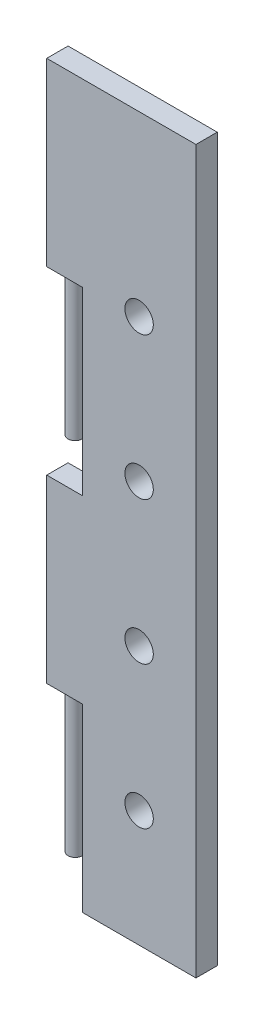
ISO-10303-21;
HEADER;
FILE_DESCRIPTION(('STEP AP214'),'2;1');
FILE_NAME('part.step','',(''),(''),'','','');
FILE_SCHEMA(('AUTOMOTIVE_DESIGN { 1 0 10303 214 1 1 1 1 }'));
ENDSEC;
DATA;
#1=APPLICATION_CONTEXT('core data for automotive mechanical design processes');
#2=APPLICATION_PROTOCOL_DEFINITION('international standard','automotive_design',2000,#1);
#3=PRODUCT_CONTEXT('',#1,'mechanical');
#4=PRODUCT('Part','Part','',(#3));
#5=PRODUCT_RELATED_PRODUCT_CATEGORY('part','',(#4));
#6=PRODUCT_DEFINITION_FORMATION('','',#4);
#7=PRODUCT_DEFINITION_CONTEXT('part definition',#1,'design');
#8=PRODUCT_DEFINITION('design','',#6,#7);
#9=PRODUCT_DEFINITION_SHAPE('','',#8);
#10=(LENGTH_UNIT() NAMED_UNIT(*) SI_UNIT(.MILLI.,.METRE.));
#11=(NAMED_UNIT(*) PLANE_ANGLE_UNIT() SI_UNIT($,.RADIAN.));
#12=(NAMED_UNIT(*) SI_UNIT($,.STERADIAN.) SOLID_ANGLE_UNIT());
#13=UNCERTAINTY_MEASURE_WITH_UNIT(LENGTH_MEASURE(1.E-05),#10,'distance_accuracy_value','');
#14=(GEOMETRIC_REPRESENTATION_CONTEXT(3) GLOBAL_UNCERTAINTY_ASSIGNED_CONTEXT((#13)) GLOBAL_UNIT_ASSIGNED_CONTEXT((#10,
#11,#12)) REPRESENTATION_CONTEXT('',''));
#15=CARTESIAN_POINT('',(0.,0.,0.));
#16=DIRECTION('',(0.,0.,1.));
#17=DIRECTION('',(1.,0.,0.));
#18=AXIS2_PLACEMENT_3D('',#15,#16,#17);
#19=CARTESIAN_POINT('',(-8.00000000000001,50.8,3.));
#20=DIRECTION('',(1.,0.,0.));
#21=DIRECTION('',(0.,1.,0.));
#22=AXIS2_PLACEMENT_3D('',#19,#20,#21);
#23=PLANE('',#22);
#24=DIRECTION('',(0.,0.,1.));
#25=VECTOR('',#24,1.);
#26=CARTESIAN_POINT('',(-8.,-25.4,3.));
#27=LINE('',#26,#25);
#28=CARTESIAN_POINT('',(-8.,-25.4,0.));
#29=VERTEX_POINT('',#28);
#30=CARTESIAN_POINT('',(-8.,-25.4,3.));
#31=VERTEX_POINT('',#30);
#32=EDGE_CURVE('E261',#29,#31,#27,.T.);
#33=ORIENTED_EDGE('',*,*,#32,.F.);
#34=DIRECTION('',(0.,-1.,0.));
#35=VECTOR('',#34,1.);
#36=CARTESIAN_POINT('',(-8.00000000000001,50.8,0.));
#37=LINE('',#36,#35);
#38=CARTESIAN_POINT('',(-8.,-50.8,0.));
#39=VERTEX_POINT('',#38);
#40=EDGE_CURVE('E134',#29,#39,#37,.T.);
#41=ORIENTED_EDGE('',*,*,#40,.T.);
#42=DIRECTION('',(0.,0.,-1.));
#43=VECTOR('',#42,1.);
#44=CARTESIAN_POINT('',(-8.,-50.8,3.));
#45=LINE('',#44,#43);
#46=CARTESIAN_POINT('',(-8.,-50.8,3.));
#47=VERTEX_POINT('',#46);
#48=EDGE_CURVE('E205',#47,#39,#45,.T.);
#49=ORIENTED_EDGE('',*,*,#48,.F.);
#50=DIRECTION('',(0.,-1.,0.));
#51=VECTOR('',#50,1.);
#52=CARTESIAN_POINT('',(-8.00000000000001,50.8,3.));
#53=LINE('',#52,#51);
#54=EDGE_CURVE('E47',#31,#47,#53,.T.);
#55=ORIENTED_EDGE('',*,*,#54,.F.);
#56=EDGE_LOOP('',(#33,#41,#49,#55));
#57=FACE_BOUND('',#56,.T.);
#58=ADVANCED_FACE('F32',(#57),#23,.F.);
#59=DIRECTION('',(0.,0.,-1.));
#60=VECTOR('',#59,1.);
#61=CARTESIAN_POINT('',(-8.,0.,3.));
#62=LINE('',#61,#60);
#63=CARTESIAN_POINT('',(-8.,0.,3.));
#64=VERTEX_POINT('',#63);
#65=CARTESIAN_POINT('',(-8.,0.,0.));
#66=VERTEX_POINT('',#65);
#67=EDGE_CURVE('E55',#64,#66,#62,.T.);
#68=ORIENTED_EDGE('',*,*,#67,.F.);
#69=CARTESIAN_POINT('',(-8.,25.4,3.));
#70=VERTEX_POINT('',#69);
#71=EDGE_CURVE('E191',#70,#64,#53,.T.);
#72=ORIENTED_EDGE('',*,*,#71,.F.);
#73=DIRECTION('',(0.,0.,1.));
#74=VECTOR('',#73,1.);
#75=CARTESIAN_POINT('',(-8.,25.4,0.));
#76=LINE('',#75,#74);
#77=CARTESIAN_POINT('',(-8.,25.4,0.));
#78=VERTEX_POINT('',#77);
#79=EDGE_CURVE('E135',#78,#70,#76,.T.);
#80=ORIENTED_EDGE('',*,*,#79,.F.);
#81=EDGE_CURVE('E200',#78,#66,#37,.T.);
#82=ORIENTED_EDGE('',*,*,#81,.T.);
#83=EDGE_LOOP('',(#68,#72,#80,#82));
#84=FACE_BOUND('',#83,.T.);
#85=ADVANCED_FACE('F229',(#84),#23,.F.);
#86=CARTESIAN_POINT('',(0.,0.,3.));
#87=DIRECTION('',(0.,0.,1.));
#88=DIRECTION('',(1.,0.,0.));
#89=AXIS2_PLACEMENT_3D('',#86,#87,#88);
#90=PLANE('',#89);
#91=CARTESIAN_POINT('',(4.23422004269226E-13,-14.332,3.));
#92=DIRECTION('',(0.,0.,1.));
#93=DIRECTION('',(1.,0.,0.));
#94=AXIS2_PLACEMENT_3D('',#91,#92,#93);
#95=CIRCLE('',#94,2.);
#96=CARTESIAN_POINT('',(2.00000000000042,-14.332,3.));
#97=VERTEX_POINT('',#96);
#98=EDGE_CURVE('E167',#97,#97,#95,.T.);
#99=ORIENTED_EDGE('',*,*,#98,.F.);
#100=EDGE_LOOP('',(#99));
#101=FACE_BOUND('',#100,.T.);
#102=CARTESIAN_POINT('',(0.,25.8,3.));
#103=DIRECTION('',(0.,0.,1.));
#104=DIRECTION('',(1.,0.,0.));
#105=AXIS2_PLACEMENT_3D('',#102,#103,#104);
#106=CIRCLE('',#105,2.);
#107=CARTESIAN_POINT('',(2.,25.8,3.));
#108=VERTEX_POINT('',#107);
#109=EDGE_CURVE('E179',#108,#108,#106,.T.);
#110=ORIENTED_EDGE('',*,*,#109,.F.);
#111=EDGE_LOOP('',(#110));
#112=FACE_BOUND('',#111,.T.);
#113=DIRECTION('',(0.,1.,0.));
#114=VECTOR('',#113,1.);
#115=CARTESIAN_POINT('',(7.99999999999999,50.8,3.));
#116=LINE('',#115,#114);
#117=CARTESIAN_POINT('',(8.00000000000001,-50.8,3.));
#118=VERTEX_POINT('',#117);
#119=CARTESIAN_POINT('',(7.99999999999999,50.8,3.));
#120=VERTEX_POINT('',#119);
#121=EDGE_CURVE('E185',#118,#120,#116,.T.);
#122=ORIENTED_EDGE('',*,*,#121,.T.);
#123=DIRECTION('',(-1.,0.,0.));
#124=VECTOR('',#123,1.);
#125=CARTESIAN_POINT('',(-8.00000000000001,50.8,3.));
#126=LINE('',#125,#124);
#127=CARTESIAN_POINT('',(-13.,50.8,3.));
#128=VERTEX_POINT('',#127);
#129=EDGE_CURVE('E188',#120,#128,#126,.T.);
#130=ORIENTED_EDGE('',*,*,#129,.T.);
#131=DIRECTION('',(0.,1.,0.));
#132=VECTOR('',#131,1.);
#133=CARTESIAN_POINT('',(-13.,50.8,3.));
#134=LINE('',#133,#132);
#135=CARTESIAN_POINT('',(-13.,25.4,3.));
#136=VERTEX_POINT('',#135);
#137=EDGE_CURVE('E148',#136,#128,#134,.T.);
#138=ORIENTED_EDGE('',*,*,#137,.F.);
#139=DIRECTION('',(1.,0.,0.));
#140=VECTOR('',#139,1.);
#141=CARTESIAN_POINT('',(-13.,25.4,3.));
#142=LINE('',#141,#140);
#143=EDGE_CURVE('E153',#136,#70,#142,.T.);
#144=ORIENTED_EDGE('',*,*,#143,.T.);
#145=ORIENTED_EDGE('',*,*,#71,.T.);
#146=DIRECTION('',(1.,0.,0.));
#147=VECTOR('',#146,1.);
#148=CARTESIAN_POINT('',(-13.,0.,3.));
#149=LINE('',#148,#147);
#150=CARTESIAN_POINT('',(-13.,0.,3.));
#151=VERTEX_POINT('',#150);
#152=EDGE_CURVE('E140',#151,#64,#149,.T.);
#153=ORIENTED_EDGE('',*,*,#152,.F.);
#154=DIRECTION('',(0.,1.,0.));
#155=VECTOR('',#154,1.);
#156=CARTESIAN_POINT('',(-13.,0.,3.));
#157=LINE('',#156,#155);
#158=CARTESIAN_POINT('',(-13.,-25.4,3.));
#159=VERTEX_POINT('',#158);
#160=EDGE_CURVE('E119',#159,#151,#157,.T.);
#161=ORIENTED_EDGE('',*,*,#160,.F.);
#162=DIRECTION('',(1.,0.,0.));
#163=VECTOR('',#162,1.);
#164=CARTESIAN_POINT('',(-13.,-25.4,3.));
#165=LINE('',#164,#163);
#166=EDGE_CURVE('E116',#159,#31,#165,.T.);
#167=ORIENTED_EDGE('',*,*,#166,.T.);
#168=ORIENTED_EDGE('',*,*,#54,.T.);
#169=DIRECTION('',(1.,0.,0.));
#170=VECTOR('',#169,1.);
#171=CARTESIAN_POINT('',(-8.,-50.8,3.));
#172=LINE('',#171,#170);
#173=EDGE_CURVE('E193',#47,#118,#172,.T.);
#174=ORIENTED_EDGE('',*,*,#173,.T.);
#175=EDGE_LOOP('',(#122,#130,#138,#144,#145,#153,#161,#167,#168,#174));
#176=FACE_BOUND('',#175,.T.);
#177=CARTESIAN_POINT('',(2.13241810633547E-13,5.73399999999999,3.));
#178=DIRECTION('',(0.,0.,1.));
#179=DIRECTION('',(1.,0.,0.));
#180=AXIS2_PLACEMENT_3D('',#177,#178,#179);
#181=CIRCLE('',#180,2.);
#182=CARTESIAN_POINT('',(2.00000000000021,5.73399999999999,3.));
#183=VERTEX_POINT('',#182);
#184=EDGE_CURVE('E173',#183,#183,#181,.T.);
#185=ORIENTED_EDGE('',*,*,#184,.F.);
#186=EDGE_LOOP('',(#185));
#187=FACE_BOUND('',#186,.T.);
#188=CARTESIAN_POINT('',(6.33602197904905E-13,-34.398,3.));
#189=DIRECTION('',(0.,0.,1.));
#190=DIRECTION('',(1.,0.,0.));
#191=AXIS2_PLACEMENT_3D('',#188,#189,#190);
#192=CIRCLE('',#191,2.);
#193=CARTESIAN_POINT('',(2.00000000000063,-34.398,3.));
#194=VERTEX_POINT('',#193);
#195=EDGE_CURVE('E161',#194,#194,#192,.T.);
#196=ORIENTED_EDGE('',*,*,#195,.F.);
#197=EDGE_LOOP('',(#196));
#198=FACE_BOUND('',#197,.T.);
#199=ADVANCED_FACE('F234',(#101,#112,#176,#187,#198),#90,.T.);
#200=CARTESIAN_POINT('',(0.,0.,0.));
#201=DIRECTION('',(0.,0.,1.));
#202=DIRECTION('',(1.,0.,0.));
#203=AXIS2_PLACEMENT_3D('',#200,#201,#202);
#204=PLANE('',#203);
#205=DIRECTION('',(0.,1.,0.));
#206=VECTOR('',#205,1.);
#207=CARTESIAN_POINT('',(7.99999999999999,50.8,0.));
#208=LINE('',#207,#206);
#209=CARTESIAN_POINT('',(8.00000000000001,-50.8,0.));
#210=VERTEX_POINT('',#209);
#211=CARTESIAN_POINT('',(7.99999999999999,50.8,0.));
#212=VERTEX_POINT('',#211);
#213=EDGE_CURVE('E182',#210,#212,#208,.T.);
#214=ORIENTED_EDGE('',*,*,#213,.F.);
#215=DIRECTION('',(1.,0.,0.));
#216=VECTOR('',#215,1.);
#217=CARTESIAN_POINT('',(-8.,-50.8,0.));
#218=LINE('',#217,#216);
#219=EDGE_CURVE('E189',#39,#210,#218,.T.);
#220=ORIENTED_EDGE('',*,*,#219,.F.);
#221=ORIENTED_EDGE('',*,*,#40,.F.);
#222=DIRECTION('',(1.,0.,0.));
#223=VECTOR('',#222,1.);
#224=CARTESIAN_POINT('',(-13.,-25.4,0.));
#225=LINE('',#224,#223);
#226=CARTESIAN_POINT('',(-13.,-25.4,0.));
#227=VERTEX_POINT('',#226);
#228=EDGE_CURVE('E114',#227,#29,#225,.T.);
#229=ORIENTED_EDGE('',*,*,#228,.F.);
#230=DIRECTION('',(0.,-1.,0.));
#231=VECTOR('',#230,1.);
#232=CARTESIAN_POINT('',(-13.,0.,0.));
#233=LINE('',#232,#231);
#234=CARTESIAN_POINT('',(-13.,0.,0.));
#235=VERTEX_POINT('',#234);
#236=EDGE_CURVE('E120',#235,#227,#233,.T.);
#237=ORIENTED_EDGE('',*,*,#236,.F.);
#238=DIRECTION('',(1.,0.,0.));
#239=VECTOR('',#238,1.);
#240=CARTESIAN_POINT('',(-13.,0.,0.));
#241=LINE('',#240,#239);
#242=EDGE_CURVE('E271',#235,#66,#241,.T.);
#243=ORIENTED_EDGE('',*,*,#242,.T.);
#244=ORIENTED_EDGE('',*,*,#81,.F.);
#245=DIRECTION('',(1.,0.,0.));
#246=VECTOR('',#245,1.);
#247=CARTESIAN_POINT('',(-13.,25.4,0.));
#248=LINE('',#247,#246);
#249=CARTESIAN_POINT('',(-13.,25.4,0.));
#250=VERTEX_POINT('',#249);
#251=EDGE_CURVE('E157',#250,#78,#248,.T.);
#252=ORIENTED_EDGE('',*,*,#251,.F.);
#253=DIRECTION('',(0.,-1.,0.));
#254=VECTOR('',#253,1.);
#255=CARTESIAN_POINT('',(-13.,50.8,0.));
#256=LINE('',#255,#254);
#257=CARTESIAN_POINT('',(-13.,50.8,0.));
#258=VERTEX_POINT('',#257);
#259=EDGE_CURVE('E138',#258,#250,#256,.T.);
#260=ORIENTED_EDGE('',*,*,#259,.F.);
#261=DIRECTION('',(-1.,0.,0.));
#262=VECTOR('',#261,1.);
#263=CARTESIAN_POINT('',(-8.00000000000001,50.8,0.));
#264=LINE('',#263,#262);
#265=EDGE_CURVE('E198',#212,#258,#264,.T.);
#266=ORIENTED_EDGE('',*,*,#265,.F.);
#267=EDGE_LOOP('',(#214,#220,#221,#229,#237,#243,#244,#252,#260,#266));
#268=FACE_BOUND('',#267,.T.);
#269=CARTESIAN_POINT('',(0.,25.8,0.));
#270=DIRECTION('',(0.,0.,1.));
#271=DIRECTION('',(1.,0.,0.));
#272=AXIS2_PLACEMENT_3D('',#269,#270,#271);
#273=CIRCLE('',#272,2.);
#274=CARTESIAN_POINT('',(2.,25.8,0.));
#275=VERTEX_POINT('',#274);
#276=EDGE_CURVE('E176',#275,#275,#273,.T.);
#277=ORIENTED_EDGE('',*,*,#276,.T.);
#278=EDGE_LOOP('',(#277));
#279=FACE_BOUND('',#278,.T.);
#280=CARTESIAN_POINT('',(2.13241810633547E-13,5.73399999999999,0.));
#281=DIRECTION('',(0.,0.,1.));
#282=DIRECTION('',(1.,0.,0.));
#283=AXIS2_PLACEMENT_3D('',#280,#281,#282);
#284=CIRCLE('',#283,2.);
#285=CARTESIAN_POINT('',(2.00000000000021,5.73399999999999,0.));
#286=VERTEX_POINT('',#285);
#287=EDGE_CURVE('E170',#286,#286,#284,.T.);
#288=ORIENTED_EDGE('',*,*,#287,.T.);
#289=EDGE_LOOP('',(#288));
#290=FACE_BOUND('',#289,.T.);
#291=CARTESIAN_POINT('',(4.23422004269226E-13,-14.332,0.));
#292=DIRECTION('',(0.,0.,1.));
#293=DIRECTION('',(1.,0.,0.));
#294=AXIS2_PLACEMENT_3D('',#291,#292,#293);
#295=CIRCLE('',#294,2.);
#296=CARTESIAN_POINT('',(2.00000000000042,-14.332,0.));
#297=VERTEX_POINT('',#296);
#298=EDGE_CURVE('E164',#297,#297,#295,.T.);
#299=ORIENTED_EDGE('',*,*,#298,.T.);
#300=EDGE_LOOP('',(#299));
#301=FACE_BOUND('',#300,.T.);
#302=CARTESIAN_POINT('',(6.33602197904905E-13,-34.398,0.));
#303=DIRECTION('',(0.,0.,1.));
#304=DIRECTION('',(1.,0.,0.));
#305=AXIS2_PLACEMENT_3D('',#302,#303,#304);
#306=CIRCLE('',#305,2.);
#307=CARTESIAN_POINT('',(2.00000000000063,-34.398,0.));
#308=VERTEX_POINT('',#307);
#309=EDGE_CURVE('E160',#308,#308,#306,.T.);
#310=ORIENTED_EDGE('',*,*,#309,.T.);
#311=EDGE_LOOP('',(#310));
#312=FACE_BOUND('',#311,.T.);
#313=ADVANCED_FACE('F131',(#268,#279,#290,#301,#312),#204,.F.);
#314=CARTESIAN_POINT('',(7.99999999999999,50.8,3.));
#315=DIRECTION('',(-1.,0.,0.));
#316=DIRECTION('',(0.,-1.,0.));
#317=AXIS2_PLACEMENT_3D('',#314,#315,#316);
#318=PLANE('',#317);
#319=ORIENTED_EDGE('',*,*,#213,.T.);
#320=DIRECTION('',(0.,0.,-1.));
#321=VECTOR('',#320,1.);
#322=CARTESIAN_POINT('',(7.99999999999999,50.8,3.));
#323=LINE('',#322,#321);
#324=EDGE_CURVE('E208',#120,#212,#323,.T.);
#325=ORIENTED_EDGE('',*,*,#324,.F.);
#326=ORIENTED_EDGE('',*,*,#121,.F.);
#327=DIRECTION('',(0.,0.,-1.));
#328=VECTOR('',#327,1.);
#329=CARTESIAN_POINT('',(8.00000000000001,-50.8,3.));
#330=LINE('',#329,#328);
#331=EDGE_CURVE('E195',#118,#210,#330,.T.);
#332=ORIENTED_EDGE('',*,*,#331,.T.);
#333=EDGE_LOOP('',(#319,#325,#326,#332));
#334=FACE_BOUND('',#333,.T.);
#335=ADVANCED_FACE('F34',(#334),#318,.F.);
#336=CARTESIAN_POINT('',(-8.00000000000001,50.8,3.));
#337=DIRECTION('',(0.,-1.,0.));
#338=DIRECTION('',(0.,0.,-1.));
#339=AXIS2_PLACEMENT_3D('',#336,#337,#338);
#340=PLANE('',#339);
#341=ORIENTED_EDGE('',*,*,#265,.T.);
#342=DIRECTION('',(0.,0.,-1.));
#343=VECTOR('',#342,1.);
#344=CARTESIAN_POINT('',(-13.,50.8,0.));
#345=LINE('',#344,#343);
#346=EDGE_CURVE('E151',#128,#258,#345,.T.);
#347=ORIENTED_EDGE('',*,*,#346,.F.);
#348=ORIENTED_EDGE('',*,*,#129,.F.);
#349=ORIENTED_EDGE('',*,*,#324,.T.);
#350=EDGE_LOOP('',(#341,#347,#348,#349));
#351=FACE_BOUND('',#350,.T.);
#352=ADVANCED_FACE('F238',(#351),#340,.F.);
#353=CARTESIAN_POINT('',(-8.,-50.8,3.));
#354=DIRECTION('',(0.,1.,0.));
#355=DIRECTION('',(0.,0.,1.));
#356=AXIS2_PLACEMENT_3D('',#353,#354,#355);
#357=PLANE('',#356);
#358=ORIENTED_EDGE('',*,*,#219,.T.);
#359=ORIENTED_EDGE('',*,*,#331,.F.);
#360=ORIENTED_EDGE('',*,*,#173,.F.);
#361=ORIENTED_EDGE('',*,*,#48,.T.);
#362=EDGE_LOOP('',(#358,#359,#360,#361));
#363=FACE_BOUND('',#362,.T.);
#364=ADVANCED_FACE('F236',(#363),#357,.F.);
#365=CARTESIAN_POINT('',(0.,25.8,3.));
#366=DIRECTION('',(0.,0.,-1.));
#367=DIRECTION('',(-1.,0.,0.));
#368=AXIS2_PLACEMENT_3D('',#365,#366,#367);
#369=CYLINDRICAL_SURFACE('',#368,2.);
#370=ORIENTED_EDGE('',*,*,#109,.T.);
#371=EDGE_LOOP('',(#370));
#372=FACE_BOUND('',#371,.T.);
#373=ORIENTED_EDGE('',*,*,#276,.F.);
#374=EDGE_LOOP('',(#373));
#375=FACE_BOUND('',#374,.T.);
#376=ADVANCED_FACE('F245',(#372,#375),#369,.F.);
#377=CARTESIAN_POINT('',(2.13241810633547E-13,5.73399999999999,3.));
#378=DIRECTION('',(0.,0.,-1.));
#379=DIRECTION('',(-1.,0.,0.));
#380=AXIS2_PLACEMENT_3D('',#377,#378,#379);
#381=CYLINDRICAL_SURFACE('',#380,2.);
#382=ORIENTED_EDGE('',*,*,#184,.T.);
#383=EDGE_LOOP('',(#382));
#384=FACE_BOUND('',#383,.T.);
#385=ORIENTED_EDGE('',*,*,#287,.F.);
#386=EDGE_LOOP('',(#385));
#387=FACE_BOUND('',#386,.T.);
#388=ADVANCED_FACE('F299',(#384,#387),#381,.F.);
#389=CARTESIAN_POINT('',(4.23422004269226E-13,-14.332,3.));
#390=DIRECTION('',(0.,0.,-1.));
#391=DIRECTION('',(-1.,0.,0.));
#392=AXIS2_PLACEMENT_3D('',#389,#390,#391);
#393=CYLINDRICAL_SURFACE('',#392,2.);
#394=ORIENTED_EDGE('',*,*,#98,.T.);
#395=EDGE_LOOP('',(#394));
#396=FACE_BOUND('',#395,.T.);
#397=ORIENTED_EDGE('',*,*,#298,.F.);
#398=EDGE_LOOP('',(#397));
#399=FACE_BOUND('',#398,.T.);
#400=ADVANCED_FACE('F293',(#396,#399),#393,.F.);
#401=CARTESIAN_POINT('',(6.33602197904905E-13,-34.398,3.));
#402=DIRECTION('',(0.,0.,-1.));
#403=DIRECTION('',(-1.,0.,0.));
#404=AXIS2_PLACEMENT_3D('',#401,#402,#403);
#405=CYLINDRICAL_SURFACE('',#404,2.);
#406=ORIENTED_EDGE('',*,*,#195,.T.);
#407=EDGE_LOOP('',(#406));
#408=FACE_BOUND('',#407,.T.);
#409=ORIENTED_EDGE('',*,*,#309,.F.);
#410=EDGE_LOOP('',(#409));
#411=FACE_BOUND('',#410,.T.);
#412=ADVANCED_FACE('F288',(#408,#411),#405,.F.);
#413=CARTESIAN_POINT('',(-13.,25.4,0.));
#414=DIRECTION('',(0.,1.,0.));
#415=DIRECTION('',(-1.,0.,0.));
#416=AXIS2_PLACEMENT_3D('',#413,#414,#415);
#417=PLANE('',#416);
#418=CARTESIAN_POINT('',(-10.5,25.4,1.5));
#419=DIRECTION('',(0.,1.,0.));
#420=DIRECTION('',(-1.,0.,0.));
#421=AXIS2_PLACEMENT_3D('',#418,#419,#420);
#422=CIRCLE('',#421,1.);
#423=CARTESIAN_POINT('',(-11.5,25.4,1.5));
#424=VERTEX_POINT('',#423);
#425=EDGE_CURVE('E11',#424,#424,#422,.F.);
#426=ORIENTED_EDGE('',*,*,#425,.F.);
#427=EDGE_LOOP('',(#426));
#428=FACE_BOUND('',#427,.T.);
#429=ORIENTED_EDGE('',*,*,#79,.T.);
#430=ORIENTED_EDGE('',*,*,#143,.F.);
#431=DIRECTION('',(0.,0.,1.));
#432=VECTOR('',#431,1.);
#433=CARTESIAN_POINT('',(-13.,25.4,0.));
#434=LINE('',#433,#432);
#435=EDGE_CURVE('E146',#250,#136,#434,.T.);
#436=ORIENTED_EDGE('',*,*,#435,.F.);
#437=ORIENTED_EDGE('',*,*,#251,.T.);
#438=EDGE_LOOP('',(#429,#430,#436,#437));
#439=FACE_BOUND('',#438,.T.);
#440=ADVANCED_FACE('F225',(#428,#439),#417,.F.);
#441=CARTESIAN_POINT('',(-13.,0.,0.));
#442=DIRECTION('',(-1.,0.,0.));
#443=DIRECTION('',(0.,-1.,0.));
#444=AXIS2_PLACEMENT_3D('',#441,#442,#443);
#445=PLANE('',#444);
#446=ORIENTED_EDGE('',*,*,#259,.T.);
#447=ORIENTED_EDGE('',*,*,#435,.T.);
#448=ORIENTED_EDGE('',*,*,#137,.T.);
#449=ORIENTED_EDGE('',*,*,#346,.T.);
#450=EDGE_LOOP('',(#446,#447,#448,#449));
#451=FACE_BOUND('',#450,.T.);
#452=ADVANCED_FACE('F217',(#451),#445,.T.);
#453=CARTESIAN_POINT('',(-13.,-25.4,3.));
#454=DIRECTION('',(0.,1.,0.));
#455=DIRECTION('',(0.,0.,1.));
#456=AXIS2_PLACEMENT_3D('',#453,#454,#455);
#457=PLANE('',#456);
#458=CARTESIAN_POINT('',(-10.5,-25.4,1.5));
#459=DIRECTION('',(0.,1.,0.));
#460=DIRECTION('',(0.,0.,1.));
#461=AXIS2_PLACEMENT_3D('',#458,#459,#460);
#462=CIRCLE('',#461,1.);
#463=CARTESIAN_POINT('',(-10.5,-25.4,2.5));
#464=VERTEX_POINT('',#463);
#465=EDGE_CURVE('E40',#464,#464,#462,.F.);
#466=ORIENTED_EDGE('',*,*,#465,.F.);
#467=EDGE_LOOP('',(#466));
#468=FACE_BOUND('',#467,.T.);
#469=ORIENTED_EDGE('',*,*,#32,.T.);
#470=ORIENTED_EDGE('',*,*,#166,.F.);
#471=DIRECTION('',(0.,0.,1.));
#472=VECTOR('',#471,1.);
#473=CARTESIAN_POINT('',(-13.,-25.4,3.));
#474=LINE('',#473,#472);
#475=EDGE_CURVE('E110',#227,#159,#474,.T.);
#476=ORIENTED_EDGE('',*,*,#475,.F.);
#477=ORIENTED_EDGE('',*,*,#228,.T.);
#478=EDGE_LOOP('',(#469,#470,#476,#477));
#479=FACE_BOUND('',#478,.T.);
#480=ADVANCED_FACE('F112',(#468,#479),#457,.F.);
#481=CARTESIAN_POINT('',(-13.,0.,3.));
#482=DIRECTION('',(0.,-1.,0.));
#483=DIRECTION('',(1.,0.,0.));
#484=AXIS2_PLACEMENT_3D('',#481,#482,#483);
#485=PLANE('',#484);
#486=ORIENTED_EDGE('',*,*,#67,.T.);
#487=ORIENTED_EDGE('',*,*,#242,.F.);
#488=DIRECTION('',(0.,0.,-1.));
#489=VECTOR('',#488,1.);
#490=CARTESIAN_POINT('',(-13.,0.,3.));
#491=LINE('',#490,#489);
#492=EDGE_CURVE('E125',#151,#235,#491,.T.);
#493=ORIENTED_EDGE('',*,*,#492,.F.);
#494=ORIENTED_EDGE('',*,*,#152,.T.);
#495=EDGE_LOOP('',(#486,#487,#493,#494));
#496=FACE_BOUND('',#495,.T.);
#497=ADVANCED_FACE('F216',(#496),#485,.F.);
#498=CARTESIAN_POINT('',(-13.,0.,0.));
#499=DIRECTION('',(1.,0.,0.));
#500=DIRECTION('',(0.,0.,-1.));
#501=AXIS2_PLACEMENT_3D('',#498,#499,#500);
#502=PLANE('',#501);
#503=ORIENTED_EDGE('',*,*,#236,.T.);
#504=ORIENTED_EDGE('',*,*,#475,.T.);
#505=ORIENTED_EDGE('',*,*,#160,.T.);
#506=ORIENTED_EDGE('',*,*,#492,.T.);
#507=EDGE_LOOP('',(#503,#504,#505,#506));
#508=FACE_BOUND('',#507,.T.);
#509=ADVANCED_FACE('F123',(#508),#502,.F.);
#510=CARTESIAN_POINT('',(-10.5,-45.4,1.49999999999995));
#511=DIRECTION('',(0.,1.,0.));
#512=DIRECTION('',(0.,0.,1.));
#513=AXIS2_PLACEMENT_3D('',#510,#511,#512);
#514=CYLINDRICAL_SURFACE('',#513,1.);
#515=CARTESIAN_POINT('',(-10.5,-45.4,1.49999999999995));
#516=DIRECTION('',(0.,-1.,0.));
#517=DIRECTION('',(0.,0.,-1.));
#518=AXIS2_PLACEMENT_3D('',#515,#516,#517);
#519=CIRCLE('',#518,1.);
#520=CARTESIAN_POINT('',(-10.5,-45.4,0.499999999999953));
#521=VERTEX_POINT('',#520);
#522=EDGE_CURVE('E262',#521,#521,#519,.T.);
#523=ORIENTED_EDGE('',*,*,#522,.F.);
#524=EDGE_LOOP('',(#523));
#525=FACE_BOUND('',#524,.T.);
#526=ORIENTED_EDGE('',*,*,#465,.T.);
#527=EDGE_LOOP('',(#526));
#528=FACE_BOUND('',#527,.T.);
#529=ADVANCED_FACE('F213',(#525,#528),#514,.T.);
#530=CARTESIAN_POINT('',(-10.5,-45.4,1.49999999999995));
#531=DIRECTION('',(0.,-1.,0.));
#532=DIRECTION('',(0.,0.,-1.));
#533=AXIS2_PLACEMENT_3D('',#530,#531,#532);
#534=PLANE('',#533);
#535=ORIENTED_EDGE('',*,*,#522,.T.);
#536=EDGE_LOOP('',(#535));
#537=FACE_BOUND('',#536,.T.);
#538=ADVANCED_FACE('F283',(#537),#534,.T.);
#539=CARTESIAN_POINT('',(-10.5,5.39999999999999,1.5));
#540=DIRECTION('',(0.,1.,0.));
#541=DIRECTION('',(-1.,0.,0.));
#542=AXIS2_PLACEMENT_3D('',#539,#540,#541);
#543=CYLINDRICAL_SURFACE('',#542,1.);
#544=CARTESIAN_POINT('',(-10.5,5.39999999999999,1.5));
#545=DIRECTION('',(0.,-1.,0.));
#546=DIRECTION('',(1.,0.,0.));
#547=AXIS2_PLACEMENT_3D('',#544,#545,#546);
#548=CIRCLE('',#547,1.);
#549=CARTESIAN_POINT('',(-9.5,5.39999999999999,1.5));
#550=VERTEX_POINT('',#549);
#551=EDGE_CURVE('E266',#550,#550,#548,.T.);
#552=ORIENTED_EDGE('',*,*,#551,.F.);
#553=EDGE_LOOP('',(#552));
#554=FACE_BOUND('',#553,.T.);
#555=ORIENTED_EDGE('',*,*,#425,.T.);
#556=EDGE_LOOP('',(#555));
#557=FACE_BOUND('',#556,.T.);
#558=ADVANCED_FACE('F280',(#554,#557),#543,.T.);
#559=CARTESIAN_POINT('',(-10.5,5.39999999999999,1.5));
#560=DIRECTION('',(0.,-1.,0.));
#561=DIRECTION('',(1.,0.,0.));
#562=AXIS2_PLACEMENT_3D('',#559,#560,#561);
#563=PLANE('',#562);
#564=ORIENTED_EDGE('',*,*,#551,.T.);
#565=EDGE_LOOP('',(#564));
#566=FACE_BOUND('',#565,.T.);
#567=ADVANCED_FACE('F278',(#566),#563,.T.);
#568=CLOSED_SHELL('',(#58,#85,#199,#313,#335,#352,#364,#376,#388,#400,#412,#440,#452,#480,#497,
#509,#529,#538,#558,#567));
#569=MANIFOLD_SOLID_BREP('B2',#568);
#570=ADVANCED_BREP_SHAPE_REPRESENTATION('',(#18,#569),#14);
#571=SHAPE_DEFINITION_REPRESENTATION(#9,#570);
ENDSEC;
END-ISO-10303-21;
